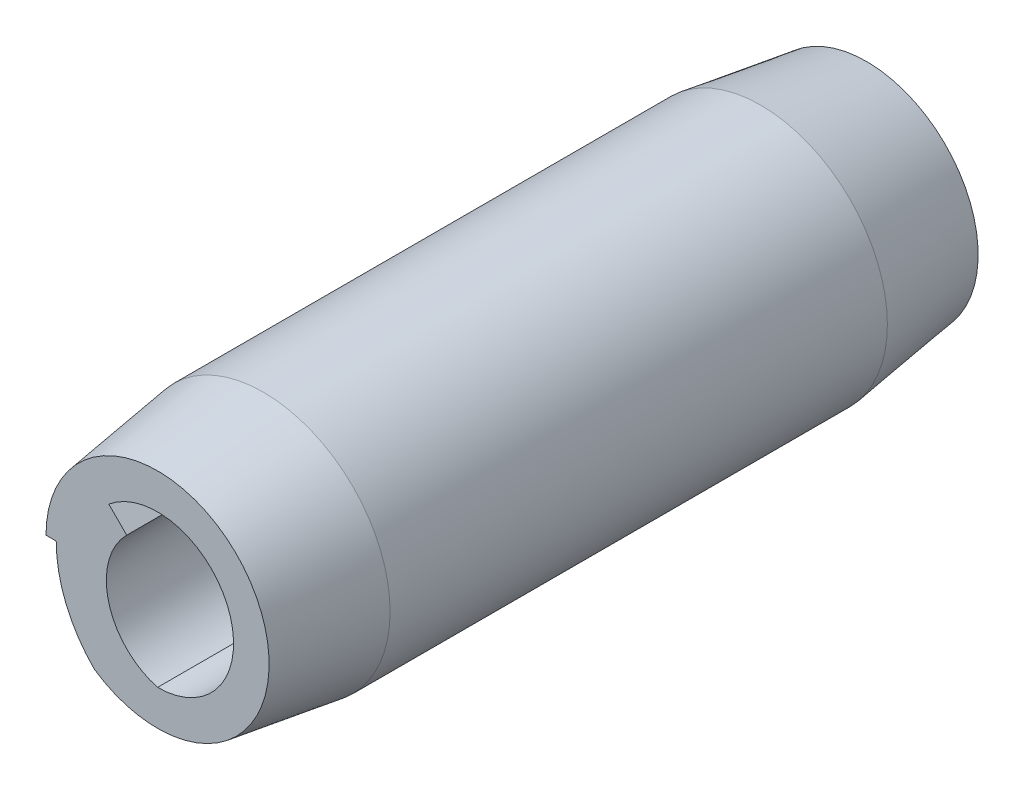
from build123d import *

# Parameters (mm, degrees)
BOSS_EXTRUDE1_DEPTH = 2.38125


with BuildPart() as part:
    # Sketch1 → Boss-Extrude1 (new, symmetric)
    with BuildSketch(Plane.XY):
        with BuildLine():
            Line((-0.8509, 0), (-0.68072, 0))
            ThreePointArc((-0.68072, 0), (-0.489599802, -0.544841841), (0, -0.8509))
            ThreePointArc((0, -0.8509), (0.60167716, 0.60167716), (-0.8509, 0))
        make_face()
        with BuildLine():
            Line((-0.327483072, 0.39167069), (-0.20714764, 0.271335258))
            ThreePointArc((-0.20714764, 0.271335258), (-0.328549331, -0.179206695), (0, -0.51054))
            ThreePointArc((0, -0.51054), (0.479903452, 0.174194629), (-0.327483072, 0.39167069))
        make_face(mode=Mode.SUBTRACT)
    extrude(amount=BOSS_EXTRUDE1_DEPTH, both=True)

    # ChamferSke → Chamfer 2 (revolve, cut)
    with BuildSketch(Plane(origin=(0, 0, 0), x_dir=(0, 0, -1), z_dir=(1, 0, 0))):
        Polygon((-2.38125, 1.46772049), (-2.38125, 0.7493), (-1.67005, 0.8509), (1.67005, 0.8509), (2.38125, 0.7493), (2.38125, 1.46772049), align=None)
    revolve(axis=Axis((0, 0, 0), (0, 0, 1)), mode=Mode.SUBTRACT)


solid = part.part
